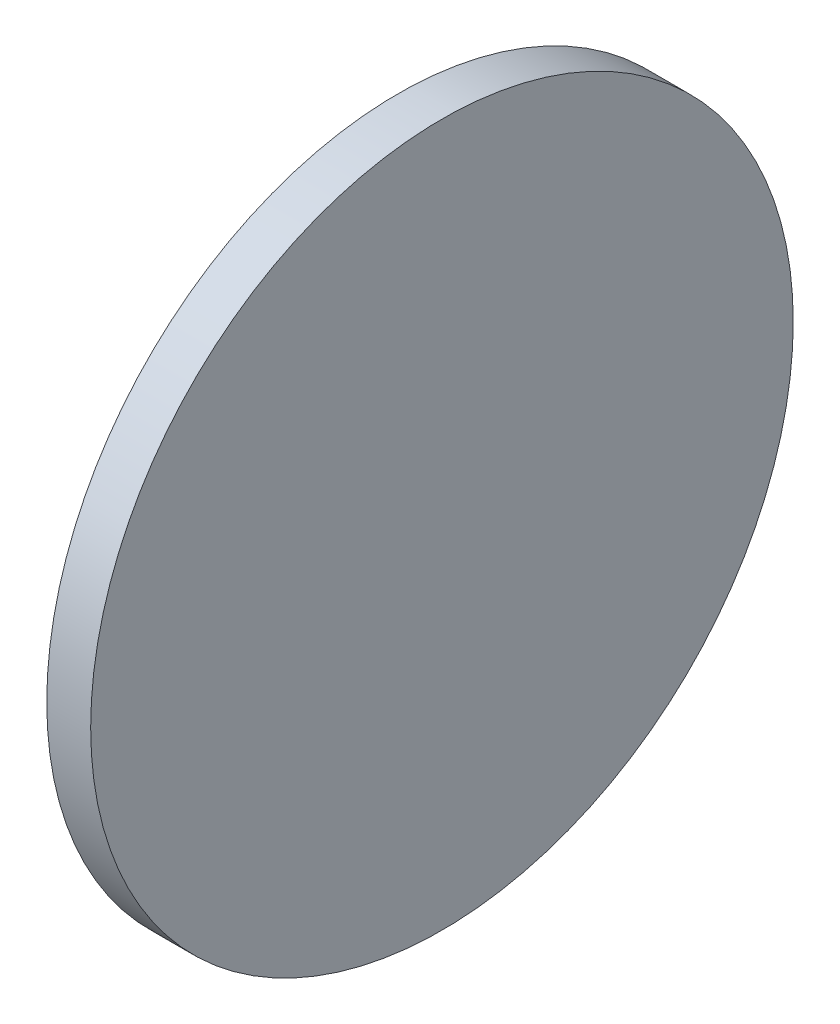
from build123d import *

# Parameters (mm, degrees)
SKETCH1_R           = 50.8
BOSS_EXTRUDE1_DEPTH = 6.35


with BuildPart() as part:
    # Sketch1 → Boss-Extrude1 (new body)
    with BuildSketch(Plane(origin=(0, 0, 0), x_dir=(0, 0, -1), z_dir=(1, 0, 0))):
        Circle(SKETCH1_R)
    extrude(amount=BOSS_EXTRUDE1_DEPTH)


solid = part.part
